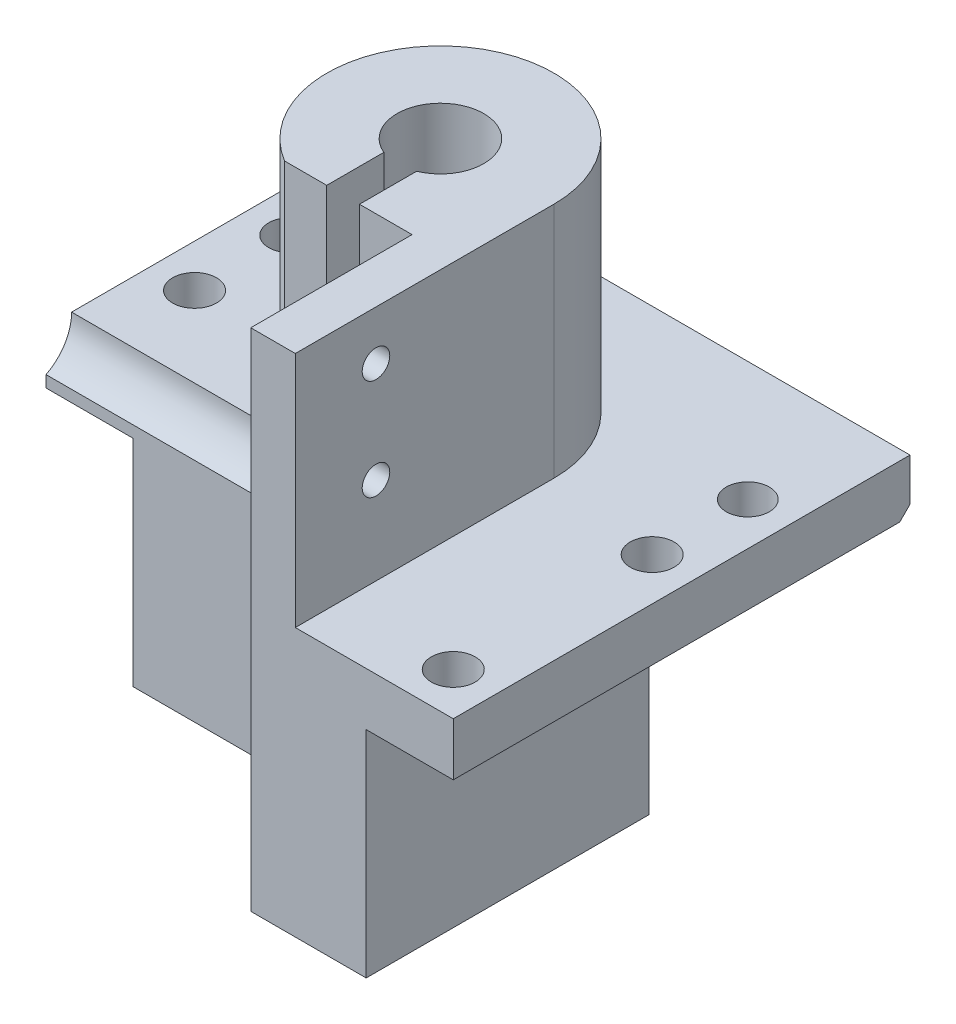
from build123d import *

# Parameters (mm, degrees)
SKETCH1_W                        = 16.891
SKETCH1_H                        = 21.59
EXTRUDE1_DEPTH                   = 25.4
EXTRUDE2_DEPTH                   = 16.002
EXTRUDE3_DEPTH                   = 3.937
CUT_EXTRUDE3_DEPTH               = 5.1308
CUT_EXTRUDE3_DEPTH_BACK          = 39.974932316
CUT_EXTRUDE4_DEPTH               = 1.2192
CUT_EXTRUDE4_DEPTH_BACK          = 1.2192
SKETCH11_W                       = 8.945217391
SKETCH11_H                       = 16.383
FILLET2_R                        = 1.143
EXTRUDE5_DEPTH                   = 4.253
SKETCH13_R                       = 3.429
CUT_EXTRUDE5_DEPTH               = 45.572675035
CHAMFER1_SIZE                    = 0.762
CUT_EXTRUDE6_DEPTH               = 17.653
M2_05_2_05_DIAMETER_HOLE1_D      = 2.05
SKETCH18_W                       = 47.591304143
SKETCH18_H                       = 18.320173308
CUT_EXTRUDE7_DEPTH               = 42.871061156
F_4_40_TAPPED_HOLE1_D            = 2.2606
F_4_40_TAPPED_HOLE1_DEPTH        = 12.065
F_1_8_0_125_DIAMETER_HOLE1_D     = 3.16738
F_1_8_0_125_DIAMETER_HOLE1_DEPTH = 6.35
F_30_0_1285_DIAMETER_HOLE1_D     = 3.2639
F_1_8_0_125_DIAMETER_HOLE2_D     = 3.2004


with BuildPart() as part:
    # Sketch1 → Extrude1 (new body)
    with BuildSketch(Plane.XY):
        with Locations((0, 10.795)):
            Rectangle(SKETCH1_W, SKETCH1_H)
    extrude(amount=EXTRUDE1_DEPTH)

    # Sketch3 → Cut-Revolve1 (revolve, cut)
    with BuildSketch(Plane(origin=(0, 0, 0), x_dir=(0, 0, -1), z_dir=(1, 0, 0)), mode=Mode.PRIVATE) as cut_revolve1_sk:
        Polygon((-7.366, 0), (-7.366, 0.381), (-7.1882, 0.428641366), (-7.1882, 21.59), (-10.414, 21.59), (-10.414, 0), align=None)
    revolve(cut_revolve1_sk.sketch.rotate(Axis((0, 19.431501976, 10.414), (0, -1, 0)), 180), axis=Axis((0, 19.431501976, 10.414), (0, -1, 0)), mode=Mode.SUBTRACT)

    # Sketch7 → Extrude2 (add)
    with BuildSketch(Plane.XZ):
        with BuildLine():
            Line((13.716, 7.840499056), (13.716, 25.4))
            Line((13.716, 25.4), (-13.716, 25.4))
            Line((-13.716, 25.4), (-13.716, 7.840499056))
            ThreePointArc((-13.716, 7.840499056), (0, 15.7988), (13.716, 7.840499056))
        make_face()
    extrude(amount=EXTRUDE2_DEPTH)

    # Sketch8 → Extrude3 (add)
    with BuildSketch(Plane(origin=(0, 0, 0), x_dir=(-1, 0, 0), z_dir=(0, 1, 0))):
        Polygon((-8.4455, 25.4), (-8.4455, 0), (0, 0), (0, -4.318), (-20.193, -4.318), (-20.193, 25.4), align=None)
    extrude3 = extrude(amount=EXTRUDE3_DEPTH)

    # Mirror1: Extrude3 across plane
    add(extrude3.mirror(Plane(origin=(0, 0, 0), x_dir=(0, 0, 1), z_dir=(1, 0, 0))))

    # Sketch10 → Cut-Extrude3 (cut, two sides: drawn at the far end of the back side and taken through both)
    with BuildSketch(Plane(origin=(0, 0, 0), x_dir=(0, 0, -1), z_dir=(1, 0, 0)).offset(-CUT_EXTRUDE3_DEPTH_BACK)):
        Polygon((-25.4, 21.59), (-17.653, 21.59), (-17.653, 3.937), (-19.558, 3.937), (-19.558, -16.002), (-25.4, -16.002), align=None)
    extrude(amount=CUT_EXTRUDE3_DEPTH + CUT_EXTRUDE3_DEPTH_BACK, mode=Mode.SUBTRACT)

    # Sketch11 → Cut-Extrude4 (cut, two sides: drawn at the far end of the back side and taken through both)
    with BuildSketch(Plane(origin=(0, 0, 0), x_dir=(0, 0, -1), z_dir=(1, 0, 0)).offset(-CUT_EXTRUDE4_DEPTH_BACK)):
        with Locations((-13.180391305, 13.3985)):
            Rectangle(SKETCH11_W, SKETCH11_H)
    extrude(amount=CUT_EXTRUDE4_DEPTH + CUT_EXTRUDE4_DEPTH_BACK, mode=Mode.SUBTRACT)

    # Fillet2
    fillet2_edges = [part.edges().sort_by_distance(p)[0] for p in [
        (-1.2192, 5.207, 15.526762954),
        (1.2192, 5.207, 15.526762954),
    ]]
    fillet(fillet2_edges, radius=FILLET2_R)

    # Sketch12 → Extrude5 (add)
    with BuildSketch(Plane.XY.offset(25.4)):
        Polygon((5.1308, -16.002), (13.716, -16.002), (13.716, 0), (20.193, 0), (20.193, 3.937), (8.4455, 3.937), (8.4455, 21.59), (5.1308, 21.59), align=None)
    extrude(amount=EXTRUDE5_DEPTH)

    # Sketch13 → Cut-Extrude5 (cut, through all)
    with BuildSketch(Plane.ZY.offset(-5.1308)):
        with Locations((21.082, 3.937)):
            Circle(SKETCH13_R)
    extrude(amount=CUT_EXTRUDE5_DEPTH, mode=Mode.SUBTRACT)

    # Chamfer1
    chamfer1_edges = [part.edges().sort_by_distance(p)[0] for p in [
        (0, 0, -4.318),
    ]]
    chamfer(chamfer1_edges, length=CHAMFER1_SIZE)

    # Sketch14 → Cut-Extrude6 (cut)
    with BuildSketch(Plane(origin=(0, 21.59, 0), x_dir=(-1, 0, 0), z_dir=(0, 1, 0))):
        with BuildLine():
            Line((-8.4455, 0), (-8.4455, 10.414))
            ThreePointArc((-8.4455, 10.414), (5.162597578, 3.730134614), (2.13387517, 18.585477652))
            Line((2.13387517, 18.585477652), (16.555773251, 18.585477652))
            Line((16.555773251, 18.585477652), (16.555773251, 0))
            Line((16.555773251, 0), (-8.4455, 0))
        make_face()
    extrude(amount=-CUT_EXTRUDE6_DEPTH, mode=Mode.SUBTRACT)

    # M2.05 _2.05_ Diameter Hole1 (through all)
    with Locations(Plane(origin=(8.4455, 0, 0), x_dir=(0, 0, -1), z_dir=(1, 0, 0))):
        with Locations((-23.653, 17.937), (-23.653, 10.437)):
            Hole(M2_05_2_05_DIAMETER_HOLE1_D / 2)

    # Sketch18 → Cut-Extrude7 (cut, through all)
    with BuildSketch(Plane.XZ):
        with Locations((-0.25501081, -0.557587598)):
            Rectangle(SKETCH18_W, SKETCH18_H)
    extrude(amount=CUT_EXTRUDE7_DEPTH, mode=Mode.SUBTRACT)

    # 4-40 Tapped Hole1
    with Locations(Plane.XZ.offset(16.002)):
        with Locations((-10.287, 16.637), (9.271, 16.637)):
            Hole(F_4_40_TAPPED_HOLE1_D / 2, depth=F_4_40_TAPPED_HOLE1_DEPTH)

    # 1_8 _0.125_ Diameter Hole1
    with Locations(Plane.XZ.offset(16.002)):
        with Locations((9.271, 25.462)):
            Hole(F_1_8_0_125_DIAMETER_HOLE1_D / 2, depth=F_1_8_0_125_DIAMETER_HOLE1_DEPTH)

    # 30 _0.1285_ Diameter Hole1 (through all)
    with Locations(Plane.XZ):
        with Locations((-17.018, 11.684), (17.018, 11.684), (17.018, 26.478)):
            Hole(F_30_0_1285_DIAMETER_HOLE1_D / 2)

    # 1_8 _0.125_ Diameter Hole2 (through all)
    with Locations(Plane(origin=(0, 3.937, 0), x_dir=(-1, 0, 0), z_dir=(0, 1, 0))):
        with Locations((-17.018, 4.572), (17.018, 4.572)):
            Hole(F_1_8_0_125_DIAMETER_HOLE2_D / 2)


solid = part.part
